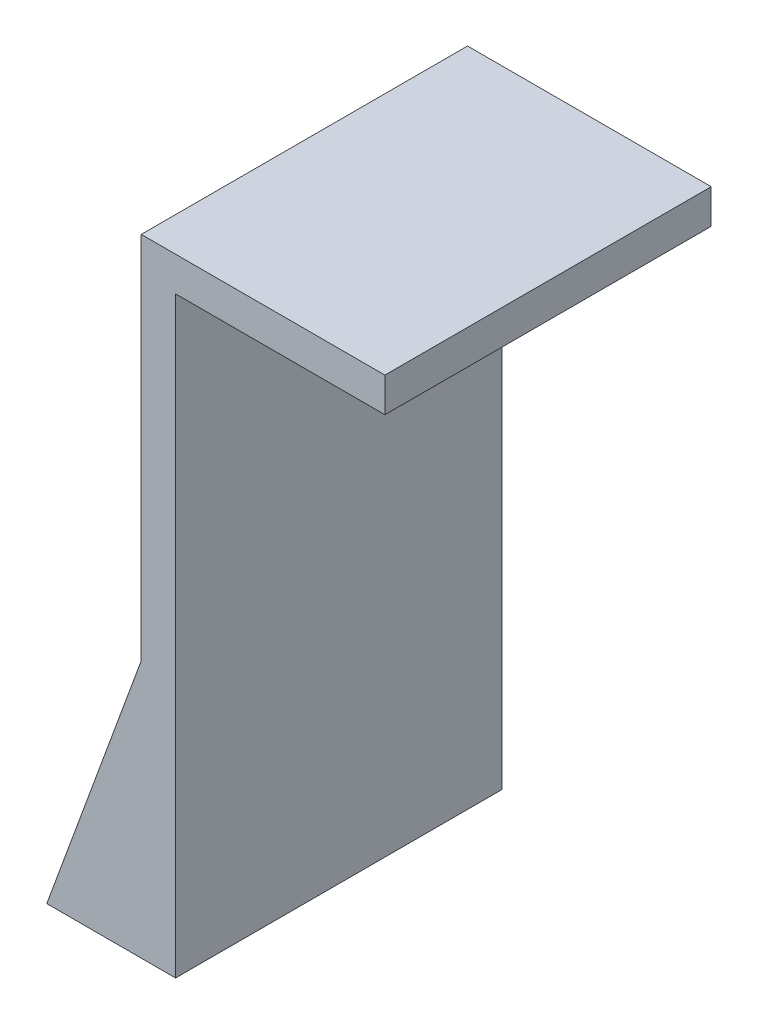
ISO-10303-21;
HEADER;
FILE_DESCRIPTION(('STEP AP214'),'2;1');
FILE_NAME('part.step','',(''),(''),'','','');
FILE_SCHEMA(('AUTOMOTIVE_DESIGN { 1 0 10303 214 1 1 1 1 }'));
ENDSEC;
DATA;
#1=APPLICATION_CONTEXT('core data for automotive mechanical design processes');
#2=APPLICATION_PROTOCOL_DEFINITION('international standard','automotive_design',2000,#1);
#3=PRODUCT_CONTEXT('',#1,'mechanical');
#4=PRODUCT('Part','Part','',(#3));
#5=PRODUCT_RELATED_PRODUCT_CATEGORY('part','',(#4));
#6=PRODUCT_DEFINITION_FORMATION('','',#4);
#7=PRODUCT_DEFINITION_CONTEXT('part definition',#1,'design');
#8=PRODUCT_DEFINITION('design','',#6,#7);
#9=PRODUCT_DEFINITION_SHAPE('','',#8);
#10=(LENGTH_UNIT() NAMED_UNIT(*) SI_UNIT(.MILLI.,.METRE.));
#11=(NAMED_UNIT(*) PLANE_ANGLE_UNIT() SI_UNIT($,.RADIAN.));
#12=(NAMED_UNIT(*) SI_UNIT($,.STERADIAN.) SOLID_ANGLE_UNIT());
#13=UNCERTAINTY_MEASURE_WITH_UNIT(LENGTH_MEASURE(1.E-05),#10,'distance_accuracy_value','');
#14=(GEOMETRIC_REPRESENTATION_CONTEXT(3) GLOBAL_UNCERTAINTY_ASSIGNED_CONTEXT((#13)) GLOBAL_UNIT_ASSIGNED_CONTEXT((#10,
#11,#12)) REPRESENTATION_CONTEXT('',''));
#15=CARTESIAN_POINT('',(0.,0.,0.));
#16=DIRECTION('',(0.,0.,1.));
#17=DIRECTION('',(1.,0.,0.));
#18=AXIS2_PLACEMENT_3D('',#15,#16,#17);
#19=CARTESIAN_POINT('',(7.5,0.,19.));
#20=DIRECTION('',(0.,1.,0.));
#21=DIRECTION('',(-1.,0.,0.));
#22=AXIS2_PLACEMENT_3D('',#19,#20,#21);
#23=PLANE('',#22);
#24=DIRECTION('',(1.,0.,0.));
#25=VECTOR('',#24,1.);
#26=CARTESIAN_POINT('',(7.5,0.,0.));
#27=LINE('',#26,#25);
#28=CARTESIAN_POINT('',(0.,0.,0.));
#29=VERTEX_POINT('',#28);
#30=CARTESIAN_POINT('',(7.5,0.,0.));
#31=VERTEX_POINT('',#30);
#32=EDGE_CURVE('E126',#29,#31,#27,.T.);
#33=ORIENTED_EDGE('',*,*,#32,.T.);
#34=DIRECTION('',(0.,0.,-1.));
#35=VECTOR('',#34,1.);
#36=CARTESIAN_POINT('',(7.5,0.,19.));
#37=LINE('',#36,#35);
#38=CARTESIAN_POINT('',(7.5,0.,19.));
#39=VERTEX_POINT('',#38);
#40=EDGE_CURVE('E11',#39,#31,#37,.T.);
#41=ORIENTED_EDGE('',*,*,#40,.F.);
#42=DIRECTION('',(1.,0.,0.));
#43=VECTOR('',#42,1.);
#44=CARTESIAN_POINT('',(7.5,0.,19.));
#45=LINE('',#44,#43);
#46=CARTESIAN_POINT('',(0.,0.,19.));
#47=VERTEX_POINT('',#46);
#48=EDGE_CURVE('E138',#47,#39,#45,.T.);
#49=ORIENTED_EDGE('',*,*,#48,.F.);
#50=DIRECTION('',(0.,0.,-1.));
#51=VECTOR('',#50,1.);
#52=CARTESIAN_POINT('',(0.,0.,19.));
#53=LINE('',#52,#51);
#54=EDGE_CURVE('E122',#47,#29,#53,.T.);
#55=ORIENTED_EDGE('',*,*,#54,.T.);
#56=EDGE_LOOP('',(#33,#41,#49,#55));
#57=FACE_BOUND('',#56,.T.);
#58=ADVANCED_FACE('F36',(#57),#23,.F.);
#59=CARTESIAN_POINT('',(7.5,34.5,19.));
#60=DIRECTION('',(-1.,0.,0.));
#61=DIRECTION('',(0.,-1.,0.));
#62=AXIS2_PLACEMENT_3D('',#59,#60,#61);
#63=PLANE('',#62);
#64=DIRECTION('',(0.,1.,0.));
#65=VECTOR('',#64,1.);
#66=CARTESIAN_POINT('',(7.5,34.5,0.));
#67=LINE('',#66,#65);
#68=CARTESIAN_POINT('',(7.5,34.5,0.));
#69=VERTEX_POINT('',#68);
#70=EDGE_CURVE('E129',#31,#69,#67,.T.);
#71=ORIENTED_EDGE('',*,*,#70,.T.);
#72=DIRECTION('',(0.,0.,-1.));
#73=VECTOR('',#72,1.);
#74=CARTESIAN_POINT('',(7.5,34.5,19.));
#75=LINE('',#74,#73);
#76=CARTESIAN_POINT('',(7.5,34.5,19.));
#77=VERTEX_POINT('',#76);
#78=EDGE_CURVE('E44',#77,#69,#75,.T.);
#79=ORIENTED_EDGE('',*,*,#78,.F.);
#80=DIRECTION('',(0.,1.,0.));
#81=VECTOR('',#80,1.);
#82=CARTESIAN_POINT('',(7.5,34.5,19.));
#83=LINE('',#82,#81);
#84=EDGE_CURVE('E92',#39,#77,#83,.T.);
#85=ORIENTED_EDGE('',*,*,#84,.F.);
#86=ORIENTED_EDGE('',*,*,#40,.T.);
#87=EDGE_LOOP('',(#71,#79,#85,#86));
#88=FACE_BOUND('',#87,.T.);
#89=ADVANCED_FACE('F163',(#88),#63,.F.);
#90=CARTESIAN_POINT('',(19.6896285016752,34.5,19.));
#91=DIRECTION('',(0.,1.,0.));
#92=DIRECTION('',(0.,0.,1.));
#93=AXIS2_PLACEMENT_3D('',#90,#91,#92);
#94=PLANE('',#93);
#95=DIRECTION('',(1.,0.,0.));
#96=VECTOR('',#95,1.);
#97=CARTESIAN_POINT('',(19.6896285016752,34.5,0.));
#98=LINE('',#97,#96);
#99=CARTESIAN_POINT('',(19.6896285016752,34.5,0.));
#100=VERTEX_POINT('',#99);
#101=EDGE_CURVE('E131',#69,#100,#98,.T.);
#102=ORIENTED_EDGE('',*,*,#101,.T.);
#103=DIRECTION('',(0.,0.,-1.));
#104=VECTOR('',#103,1.);
#105=CARTESIAN_POINT('',(19.6896285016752,34.5,19.));
#106=LINE('',#105,#104);
#107=CARTESIAN_POINT('',(19.6896285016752,34.5,19.));
#108=VERTEX_POINT('',#107);
#109=EDGE_CURVE('E142',#108,#100,#106,.T.);
#110=ORIENTED_EDGE('',*,*,#109,.F.);
#111=DIRECTION('',(1.,0.,0.));
#112=VECTOR('',#111,1.);
#113=CARTESIAN_POINT('',(19.6896285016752,34.5,19.));
#114=LINE('',#113,#112);
#115=EDGE_CURVE('E150',#77,#108,#114,.T.);
#116=ORIENTED_EDGE('',*,*,#115,.F.);
#117=ORIENTED_EDGE('',*,*,#78,.T.);
#118=EDGE_LOOP('',(#102,#110,#116,#117));
#119=FACE_BOUND('',#118,.T.);
#120=ADVANCED_FACE('F148',(#119),#94,.F.);
#121=CARTESIAN_POINT('',(19.6896285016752,36.5,19.));
#122=DIRECTION('',(-1.,0.,0.));
#123=DIRECTION('',(0.,0.,1.));
#124=AXIS2_PLACEMENT_3D('',#121,#122,#123);
#125=PLANE('',#124);
#126=DIRECTION('',(0.,1.,0.));
#127=VECTOR('',#126,1.);
#128=CARTESIAN_POINT('',(19.6896285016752,36.5,0.));
#129=LINE('',#128,#127);
#130=CARTESIAN_POINT('',(19.6896285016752,36.5,0.));
#131=VERTEX_POINT('',#130);
#132=EDGE_CURVE('E133',#100,#131,#129,.T.);
#133=ORIENTED_EDGE('',*,*,#132,.T.);
#134=DIRECTION('',(0.,0.,-1.));
#135=VECTOR('',#134,1.);
#136=CARTESIAN_POINT('',(19.6896285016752,36.5,19.));
#137=LINE('',#136,#135);
#138=CARTESIAN_POINT('',(19.6896285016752,36.5,19.));
#139=VERTEX_POINT('',#138);
#140=EDGE_CURVE('E117',#139,#131,#137,.T.);
#141=ORIENTED_EDGE('',*,*,#140,.F.);
#142=DIRECTION('',(0.,1.,0.));
#143=VECTOR('',#142,1.);
#144=CARTESIAN_POINT('',(19.6896285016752,36.5,19.));
#145=LINE('',#144,#143);
#146=EDGE_CURVE('E108',#108,#139,#145,.T.);
#147=ORIENTED_EDGE('',*,*,#146,.F.);
#148=ORIENTED_EDGE('',*,*,#109,.T.);
#149=EDGE_LOOP('',(#133,#141,#147,#148));
#150=FACE_BOUND('',#149,.T.);
#151=ADVANCED_FACE('F156',(#150),#125,.F.);
#152=CARTESIAN_POINT('',(5.5,36.5,19.));
#153=DIRECTION('',(0.,-1.,0.));
#154=DIRECTION('',(0.,0.,-1.));
#155=AXIS2_PLACEMENT_3D('',#152,#153,#154);
#156=PLANE('',#155);
#157=DIRECTION('',(-1.,0.,0.));
#158=VECTOR('',#157,1.);
#159=CARTESIAN_POINT('',(5.5,36.5,0.));
#160=LINE('',#159,#158);
#161=CARTESIAN_POINT('',(5.5,36.5,0.));
#162=VERTEX_POINT('',#161);
#163=EDGE_CURVE('E116',#131,#162,#160,.T.);
#164=ORIENTED_EDGE('',*,*,#163,.T.);
#165=DIRECTION('',(0.,0.,-1.));
#166=VECTOR('',#165,1.);
#167=CARTESIAN_POINT('',(5.5,36.5,19.));
#168=LINE('',#167,#166);
#169=CARTESIAN_POINT('',(5.5,36.5,19.));
#170=VERTEX_POINT('',#169);
#171=EDGE_CURVE('E113',#170,#162,#168,.T.);
#172=ORIENTED_EDGE('',*,*,#171,.F.);
#173=DIRECTION('',(-1.,0.,0.));
#174=VECTOR('',#173,1.);
#175=CARTESIAN_POINT('',(5.5,36.5,19.));
#176=LINE('',#175,#174);
#177=EDGE_CURVE('E102',#139,#170,#176,.T.);
#178=ORIENTED_EDGE('',*,*,#177,.F.);
#179=ORIENTED_EDGE('',*,*,#140,.T.);
#180=EDGE_LOOP('',(#164,#172,#178,#179));
#181=FACE_BOUND('',#180,.T.);
#182=ADVANCED_FACE('F114',(#181),#156,.F.);
#183=CARTESIAN_POINT('',(5.5,15.,19.));
#184=DIRECTION('',(1.,0.,0.));
#185=DIRECTION('',(0.,1.,0.));
#186=AXIS2_PLACEMENT_3D('',#183,#184,#185);
#187=PLANE('',#186);
#188=DIRECTION('',(0.,-1.,0.));
#189=VECTOR('',#188,1.);
#190=CARTESIAN_POINT('',(5.5,15.,0.));
#191=LINE('',#190,#189);
#192=CARTESIAN_POINT('',(5.5,15.,0.));
#193=VERTEX_POINT('',#192);
#194=EDGE_CURVE('E78',#162,#193,#191,.T.);
#195=ORIENTED_EDGE('',*,*,#194,.T.);
#196=DIRECTION('',(0.,0.,-1.));
#197=VECTOR('',#196,1.);
#198=CARTESIAN_POINT('',(5.5,15.,19.));
#199=LINE('',#198,#197);
#200=CARTESIAN_POINT('',(5.5,15.,19.));
#201=VERTEX_POINT('',#200);
#202=EDGE_CURVE('E118',#201,#193,#199,.T.);
#203=ORIENTED_EDGE('',*,*,#202,.F.);
#204=DIRECTION('',(0.,-1.,0.));
#205=VECTOR('',#204,1.);
#206=CARTESIAN_POINT('',(5.5,15.,19.));
#207=LINE('',#206,#205);
#208=EDGE_CURVE('E106',#170,#201,#207,.T.);
#209=ORIENTED_EDGE('',*,*,#208,.F.);
#210=ORIENTED_EDGE('',*,*,#171,.T.);
#211=EDGE_LOOP('',(#195,#203,#209,#210));
#212=FACE_BOUND('',#211,.T.);
#213=ADVANCED_FACE('F120',(#212),#187,.F.);
#214=CARTESIAN_POINT('',(0.,0.,19.));
#215=DIRECTION('',(0.938876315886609,-0.344254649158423,0.));
#216=DIRECTION('',(0.344254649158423,0.938876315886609,0.));
#217=AXIS2_PLACEMENT_3D('',#214,#215,#216);
#218=PLANE('',#217);
#219=DIRECTION('',(-0.344254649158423,-0.938876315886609,0.));
#220=VECTOR('',#219,1.);
#221=CARTESIAN_POINT('',(0.,0.,0.));
#222=LINE('',#221,#220);
#223=EDGE_CURVE('E84',#193,#29,#222,.T.);
#224=ORIENTED_EDGE('',*,*,#223,.T.);
#225=ORIENTED_EDGE('',*,*,#54,.F.);
#226=DIRECTION('',(-0.344254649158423,-0.938876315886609,0.));
#227=VECTOR('',#226,1.);
#228=CARTESIAN_POINT('',(0.,0.,19.));
#229=LINE('',#228,#227);
#230=EDGE_CURVE('E52',#201,#47,#229,.T.);
#231=ORIENTED_EDGE('',*,*,#230,.F.);
#232=ORIENTED_EDGE('',*,*,#202,.T.);
#233=EDGE_LOOP('',(#224,#225,#231,#232));
#234=FACE_BOUND('',#233,.T.);
#235=ADVANCED_FACE('F177',(#234),#218,.F.);
#236=CARTESIAN_POINT('',(0.,0.,19.));
#237=DIRECTION('',(0.,0.,-1.));
#238=DIRECTION('',(-1.,0.,0.));
#239=AXIS2_PLACEMENT_3D('',#236,#237,#238);
#240=PLANE('',#239);
#241=ORIENTED_EDGE('',*,*,#48,.T.);
#242=ORIENTED_EDGE('',*,*,#84,.T.);
#243=ORIENTED_EDGE('',*,*,#115,.T.);
#244=ORIENTED_EDGE('',*,*,#146,.T.);
#245=ORIENTED_EDGE('',*,*,#177,.T.);
#246=ORIENTED_EDGE('',*,*,#208,.T.);
#247=ORIENTED_EDGE('',*,*,#230,.T.);
#248=EDGE_LOOP('',(#241,#242,#243,#244,#245,#246,#247));
#249=FACE_BOUND('',#248,.T.);
#250=ADVANCED_FACE('F104',(#249),#240,.F.);
#251=CARTESIAN_POINT('',(0.,0.,0.));
#252=DIRECTION('',(0.,0.,-1.));
#253=DIRECTION('',(-1.,0.,0.));
#254=AXIS2_PLACEMENT_3D('',#251,#252,#253);
#255=PLANE('',#254);
#256=ORIENTED_EDGE('',*,*,#32,.F.);
#257=ORIENTED_EDGE('',*,*,#223,.F.);
#258=ORIENTED_EDGE('',*,*,#194,.F.);
#259=ORIENTED_EDGE('',*,*,#163,.F.);
#260=ORIENTED_EDGE('',*,*,#132,.F.);
#261=ORIENTED_EDGE('',*,*,#101,.F.);
#262=ORIENTED_EDGE('',*,*,#70,.F.);
#263=EDGE_LOOP('',(#256,#257,#258,#259,#260,#261,#262));
#264=FACE_BOUND('',#263,.T.);
#265=ADVANCED_FACE('F154',(#264),#255,.T.);
#266=CLOSED_SHELL('',(#58,#89,#120,#151,#182,#213,#235,#250,#265));
#267=MANIFOLD_SOLID_BREP('B2',#266);
#268=ADVANCED_BREP_SHAPE_REPRESENTATION('',(#18,#267),#14);
#269=SHAPE_DEFINITION_REPRESENTATION(#9,#268);
ENDSEC;
END-ISO-10303-21;
